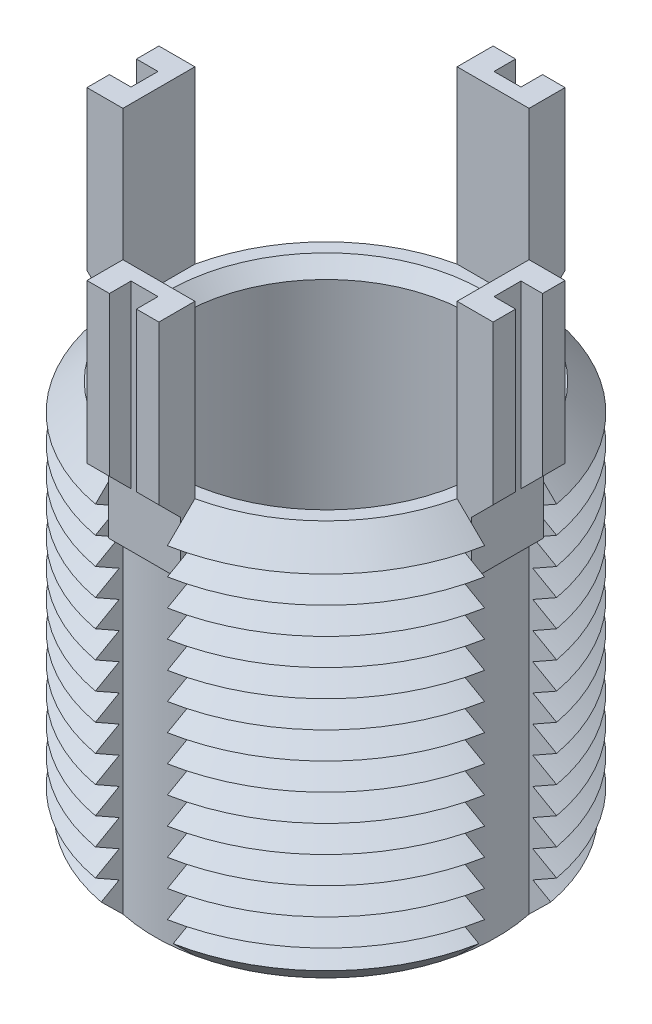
from build123d import *

# Parameters (mm, degrees)
SKETCH1_R               = 11
BOSS_EXTRUDE1_DEPTH     = 22
CHAMFER1_SIZE           = 1.5
LPATTERN1_COUNT         = 13
LPATTERN1_PITCH         = 1.5
CUT_EXTRUDE1_REACH      = 28.944
CIRPATTERN1_COUNT       = 4
BOSS_EXTRUDE3_DEPTH     = 2
CIRPATTERN2_COUNT       = 4
CUT_EXTRUDE3_DEPTH      = 36.313548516
CUT_EXTRUDE3_DEPTH_BACK = 36.313548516
SKETCH6_W               = 1.2
SKETCH6_H               = 1.5
SKETCH6_W_2             = 1.5
SKETCH6_H_2             = 1.2
SKETCH7_R               = 8
CUT_EXTRUDE4_DEPTH      = 22
CHAMFER2_SIZE           = 0.75


with BuildPart() as part:
    # Sketch1 → Boss-Extrude1 (new body)
    with BuildSketch(Plane(origin=(0, 0, 0), x_dir=(1, 0, 0), z_dir=(0, 1, 0))):
        with Locations(Location((0, 0, 0), (0, 0, 270))):
            Circle(SKETCH1_R)
    extrude(amount=-BOSS_EXTRUDE1_DEPTH)

    # Chamfer1
    chamfer1_edges = [part.edges().sort_by_distance(p)[0] for p in [
        (0, 0, -11),
        (0, -22, -11),
    ]]
    chamfer(chamfer1_edges, length=CHAMFER1_SIZE)

    # Sketch3 → Cut-Revolve1 (revolve, cut)
    with BuildSketch(Plane(origin=(0, 0, 0), x_dir=(0, 0, -1), z_dir=(1, 0, 0))):
        Polygon((-11, -1.5), (-9.700961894, -2.25), (-11, -3), align=None)
    cut_revolve1 = revolve(axis=Axis((0, 0.885892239, 0), (0, -1, 0)), mode=Mode.SUBTRACT)

    # LPattern1: Cut-Revolve1 ×13
    with Locations(*[(0, -i * LPATTERN1_PITCH, 0) for i in range(1, LPATTERN1_COUNT)]):
        add(cut_revolve1, mode=Mode.SUBTRACT)

    # Cut-Extrude1: up to this cone (the profile starts inside it)
    cut_extrude1_end = Plane(origin=(0, 0, 0), z_dir=(0, 1, 0)).offset(-31.499999) * Cone(1e-06, 92.444, 92.443999, align=(Align.CENTER, Align.CENTER, Align.MIN), mode=Mode.PRIVATE)
    # Sketch4 → Cut-Extrude1 (cut, up to the surface)
    with BuildSketch(Plane(origin=(0, 0, 0), x_dir=(1, 0, 0), z_dir=(0, 1, 0)), mode=Mode.PRIVATE) as cut_extrude1_sk1:
        with BuildLine():
            Line((-9.287087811, 2), (-10.816653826, 2))
            ThreePointArc((-10.816653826, 2), (-11, 0), (-10.816653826, -2))
            Line((-10.816653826, -2), (-9.287087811, -2))
            ThreePointArc((-9.287087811, -2), (-9.5, 0), (-9.287087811, 2))
        make_face()
    cut_extrude1_tool1 = extrude(cut_extrude1_sk1.sketch, amount=-CUT_EXTRUDE1_REACH, mode=Mode.PRIVATE) & cut_extrude1_end
    cut_extrude1 = cut_extrude1_tool1.solids().sort_by_distance((-10.183877, 0, 0))[0]
    add(cut_extrude1, mode=Mode.SUBTRACT)

    # CirPattern1: Cut-Extrude1 ×4 about axis
    cirpattern1_axis = Axis((0, 0, 0), (0, 1, 0))
    for i in range(1, CIRPATTERN1_COUNT):
        add(cut_extrude1.rotate(cirpattern1_axis, i * 360 / CIRPATTERN1_COUNT), mode=Mode.SUBTRACT)

    # Sketch5 → Boss-Extrude3 (add, symmetric)
    with BuildSketch(Plane(origin=(0, 0, 0), x_dir=(0, 0, -1), z_dir=(1, 0, 0))):
        Polygon((-9.287087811, 9.5), (-9.287087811, -3.5), (-10.087087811, -3.5), (-10.087087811, -0.5), (-11.287087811, 0.7), (-11.287087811, 9.5), align=None)
    boss_extrude3 = extrude(amount=BOSS_EXTRUDE3_DEPTH, both=True)

    # CirPattern2: Boss-Extrude3 ×4 about axis
    cirpattern2_axis = Axis((0, 0, 0), (0, 1, 0))
    for i in range(1, CIRPATTERN2_COUNT):
        add(boss_extrude3.rotate(cirpattern2_axis, i * 360 / CIRPATTERN2_COUNT))

    # Sketch6 → Cut-Extrude3 (cut, two sides: drawn at the far end of the back side and taken through both)
    with BuildSketch(Plane(origin=(0, 9.5, 0), x_dir=(1, 0, 0), z_dir=(0, 1, 0)).offset(-CUT_EXTRUDE3_DEPTH_BACK)):
        with Locations((-10.687087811, 0)):
            Rectangle(SKETCH6_W, SKETCH6_H)
        with Locations((0, 10.687087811)):
            Rectangle(SKETCH6_W_2, SKETCH6_H_2)
        with Locations((10.687087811, 0)):
            Rectangle(SKETCH6_W, SKETCH6_H)
        with Locations((0, -10.687087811)):
            Rectangle(SKETCH6_W_2, SKETCH6_H_2)
    extrude(amount=CUT_EXTRUDE3_DEPTH + CUT_EXTRUDE3_DEPTH_BACK, mode=Mode.SUBTRACT)

    # Sketch7 → Cut-Extrude4 (cut)
    with BuildSketch(Plane(origin=(0, 0, 0), x_dir=(1, 0, 0), z_dir=(0, 1, 0))):
        with Locations(Location((0, 0, 0), (0, 0, 270))):
            Circle(SKETCH7_R)
    extrude(amount=-CUT_EXTRUDE4_DEPTH, mode=Mode.SUBTRACT)

    # Chamfer2
    chamfer2_edges = [part.edges().sort_by_distance(p)[0] for p in [
        (0, 0, -8),
        (0, -22, -8),
    ]]
    chamfer(chamfer2_edges, length=CHAMFER2_SIZE)


solid = part.part
